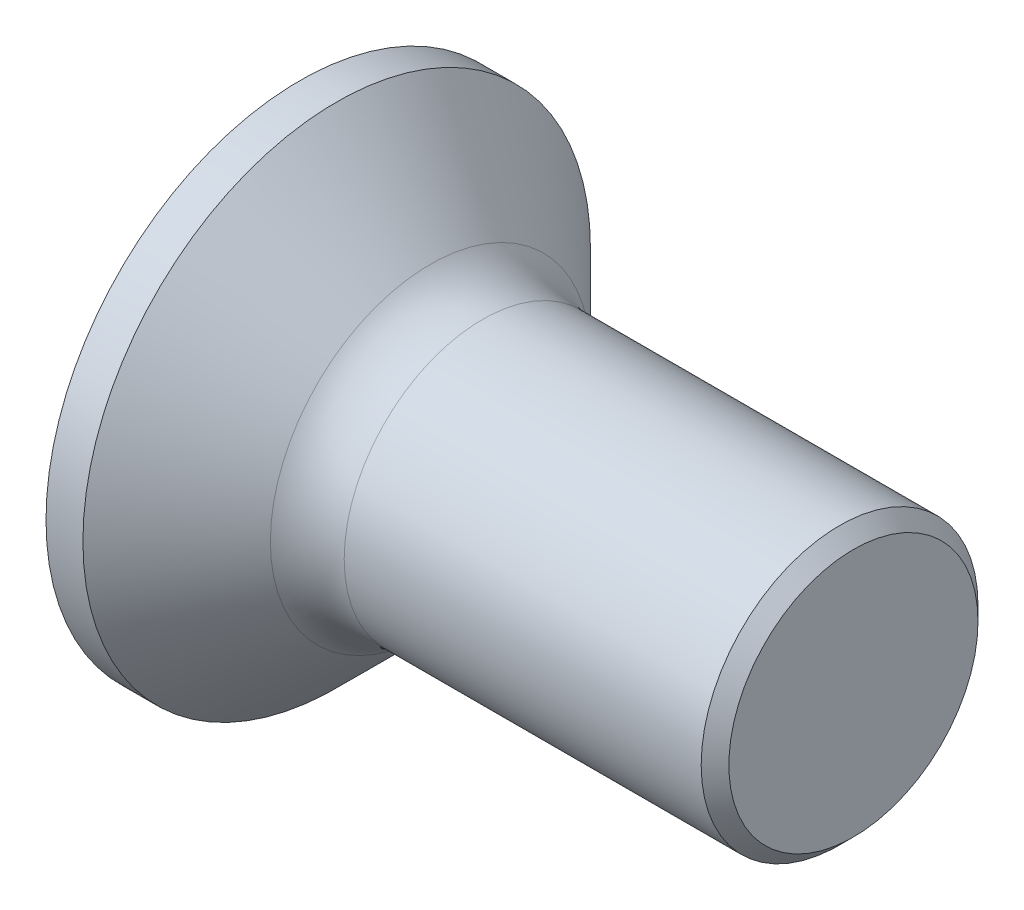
ISO-10303-21;
HEADER;
FILE_DESCRIPTION(('STEP AP214'),'2;1');
FILE_NAME('part.step','',(''),(''),'','','');
FILE_SCHEMA(('AUTOMOTIVE_DESIGN { 1 0 10303 214 1 1 1 1 }'));
ENDSEC;
DATA;
#1=APPLICATION_CONTEXT('core data for automotive mechanical design processes');
#2=APPLICATION_PROTOCOL_DEFINITION('international standard','automotive_design',2000,#1);
#3=PRODUCT_CONTEXT('',#1,'mechanical');
#4=PRODUCT('Part','Part','',(#3));
#5=PRODUCT_RELATED_PRODUCT_CATEGORY('part','',(#4));
#6=PRODUCT_DEFINITION_FORMATION('','',#4);
#7=PRODUCT_DEFINITION_CONTEXT('part definition',#1,'design');
#8=PRODUCT_DEFINITION('design','',#6,#7);
#9=PRODUCT_DEFINITION_SHAPE('','',#8);
#10=(LENGTH_UNIT() NAMED_UNIT(*) SI_UNIT(.MILLI.,.METRE.));
#11=(NAMED_UNIT(*) PLANE_ANGLE_UNIT() SI_UNIT($,.RADIAN.));
#12=(NAMED_UNIT(*) SI_UNIT($,.STERADIAN.) SOLID_ANGLE_UNIT());
#13=UNCERTAINTY_MEASURE_WITH_UNIT(LENGTH_MEASURE(1.E-05),#10,'distance_accuracy_value','');
#14=(GEOMETRIC_REPRESENTATION_CONTEXT(3) GLOBAL_UNCERTAINTY_ASSIGNED_CONTEXT((#13)) GLOBAL_UNIT_ASSIGNED_CONTEXT((#10,
#11,#12)) REPRESENTATION_CONTEXT('',''));
#15=CARTESIAN_POINT('',(0.,0.,0.));
#16=DIRECTION('',(0.,0.,1.));
#17=DIRECTION('',(1.,0.,0.));
#18=AXIS2_PLACEMENT_3D('',#15,#16,#17);
#19=CARTESIAN_POINT('',(0.2,0.,0.));
#20=DIRECTION('',(-1.,0.,0.));
#21=DIRECTION('',(0.,0.,1.));
#22=AXIS2_PLACEMENT_3D('',#19,#20,#21);
#23=CYLINDRICAL_SURFACE('',#22,2.75);
#24=CARTESIAN_POINT('',(0.4,0.,0.));
#25=DIRECTION('',(-1.,0.,0.));
#26=DIRECTION('',(0.,0.,-1.));
#27=AXIS2_PLACEMENT_3D('',#24,#25,#26);
#28=CIRCLE('',#27,2.75);
#29=CARTESIAN_POINT('',(0.4,0.,-2.75));
#30=VERTEX_POINT('',#29);
#31=EDGE_CURVE('E412',#30,#30,#28,.T.);
#32=ORIENTED_EDGE('',*,*,#31,.T.);
#33=EDGE_LOOP('',(#32));
#34=FACE_BOUND('',#33,.T.);
#35=CARTESIAN_POINT('',(0.,0.,0.));
#36=DIRECTION('',(-1.,0.,0.));
#37=DIRECTION('',(0.,0.,-1.));
#38=AXIS2_PLACEMENT_3D('',#35,#36,#37);
#39=CIRCLE('',#38,2.75);
#40=CARTESIAN_POINT('',(0.,0.,-2.75));
#41=VERTEX_POINT('',#40);
#42=EDGE_CURVE('E265',#41,#41,#39,.T.);
#43=ORIENTED_EDGE('',*,*,#42,.F.);
#44=EDGE_LOOP('',(#43));
#45=FACE_BOUND('',#44,.T.);
#46=ADVANCED_FACE('F17',(#34,#45),#23,.T.);
#47=DIRECTION('',(0.707106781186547,0.,0.707106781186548));
#48=VECTOR('',#47,1.);
#49=CARTESIAN_POINT('',(-498996.85,-1.22215714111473E-10,-499000.));
#50=LINE('',#49,#48);
#51=CARTESIAN_POINT('',(3.15,0.,0.));
#52=DIRECTION('',(-1.,0.,0.));
#53=AXIS1_PLACEMENT('',#51,#52);
#54=SURFACE_OF_REVOLUTION('',#50,#53);
#55=CARTESIAN_POINT('',(1.41568542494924,0.,0.));
#56=DIRECTION('',(-1.,0.,0.));
#57=DIRECTION('',(0.,0.,-1.));
#58=AXIS2_PLACEMENT_3D('',#55,#56,#57);
#59=CIRCLE('',#58,1.73431457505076);
#60=CARTESIAN_POINT('',(1.41568542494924,0.,-1.73431457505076));
#61=VERTEX_POINT('',#60);
#62=EDGE_CURVE('E11',#61,#61,#59,.T.);
#63=ORIENTED_EDGE('',*,*,#62,.T.);
#64=EDGE_LOOP('',(#63));
#65=FACE_BOUND('',#64,.T.);
#66=ORIENTED_EDGE('',*,*,#31,.F.);
#67=EDGE_LOOP('',(#66));
#68=FACE_BOUND('',#67,.T.);
#69=ADVANCED_FACE('F270',(#65,#68),#54,.F.);
#70=CARTESIAN_POINT('',(1.98137084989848,0.,0.));
#71=DIRECTION('',(-1.,0.,0.));
#72=DIRECTION('',(0.,0.,1.));
#73=AXIS2_PLACEMENT_3D('',#70,#71,#72);
#74=TOROIDAL_SURFACE('',#73,2.3,0.8);
#75=CARTESIAN_POINT('',(1.98137084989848,0.,0.));
#76=DIRECTION('',(-1.,0.,0.));
#77=DIRECTION('',(0.,0.,-1.));
#78=AXIS2_PLACEMENT_3D('',#75,#76,#77);
#79=CIRCLE('',#78,1.5);
#80=CARTESIAN_POINT('',(1.98137084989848,0.,-1.5));
#81=VERTEX_POINT('',#80);
#82=EDGE_CURVE('E27',#81,#81,#79,.T.);
#83=ORIENTED_EDGE('',*,*,#82,.T.);
#84=EDGE_LOOP('',(#83));
#85=FACE_BOUND('',#84,.T.);
#86=ORIENTED_EDGE('',*,*,#62,.F.);
#87=EDGE_LOOP('',(#86));
#88=FACE_BOUND('',#87,.T.);
#89=ADVANCED_FACE('F274',(#85,#88),#74,.F.);
#90=CARTESIAN_POINT('',(3.91568542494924,0.,0.));
#91=DIRECTION('',(-1.,0.,0.));
#92=DIRECTION('',(0.,0.,1.));
#93=AXIS2_PLACEMENT_3D('',#90,#91,#92);
#94=CYLINDRICAL_SURFACE('',#93,1.5);
#95=CARTESIAN_POINT('',(5.85,0.,0.));
#96=DIRECTION('',(-1.,0.,0.));
#97=DIRECTION('',(0.,0.,-1.));
#98=AXIS2_PLACEMENT_3D('',#95,#96,#97);
#99=CIRCLE('',#98,1.5);
#100=CARTESIAN_POINT('',(5.85,0.,-1.5));
#101=VERTEX_POINT('',#100);
#102=EDGE_CURVE('E448',#101,#101,#99,.T.);
#103=ORIENTED_EDGE('',*,*,#102,.T.);
#104=EDGE_LOOP('',(#103));
#105=FACE_BOUND('',#104,.T.);
#106=ORIENTED_EDGE('',*,*,#82,.F.);
#107=EDGE_LOOP('',(#106));
#108=FACE_BOUND('',#107,.T.);
#109=ADVANCED_FACE('F278',(#105,#108),#94,.T.);
#110=DIRECTION('',(0.707106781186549,0.,0.707106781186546));
#111=VECTOR('',#110,1.);
#112=CARTESIAN_POINT('',(-498992.650000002,-1.22215714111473E-10,-499000.));
#113=LINE('',#112,#111);
#114=CARTESIAN_POINT('',(7.35,0.,0.));
#115=DIRECTION('',(-1.,0.,0.));
#116=AXIS1_PLACEMENT('',#114,#115);
#117=SURFACE_OF_REVOLUTION('',#113,#116);
#118=CARTESIAN_POINT('',(6.,0.,0.));
#119=DIRECTION('',(-1.,0.,0.));
#120=DIRECTION('',(0.,0.,-1.));
#121=AXIS2_PLACEMENT_3D('',#118,#119,#120);
#122=CIRCLE('',#121,1.35);
#123=CARTESIAN_POINT('',(6.,0.,-1.35));
#124=VERTEX_POINT('',#123);
#125=EDGE_CURVE('E444',#124,#124,#122,.T.);
#126=ORIENTED_EDGE('',*,*,#125,.T.);
#127=EDGE_LOOP('',(#126));
#128=FACE_BOUND('',#127,.T.);
#129=ORIENTED_EDGE('',*,*,#102,.F.);
#130=EDGE_LOOP('',(#129));
#131=FACE_BOUND('',#130,.T.);
#132=ADVANCED_FACE('F282',(#128,#131),#117,.F.);
#133=CARTESIAN_POINT('',(6.,0.,-0.675));
#134=DIRECTION('',(1.,0.,0.));
#135=DIRECTION('',(0.,1.,0.));
#136=AXIS2_PLACEMENT_3D('',#133,#134,#135);
#137=PLANE('',#136);
#138=ORIENTED_EDGE('',*,*,#125,.F.);
#139=EDGE_LOOP('',(#138));
#140=FACE_BOUND('',#139,.T.);
#141=ADVANCED_FACE('F286',(#140),#137,.T.);
#142=CARTESIAN_POINT('',(-1.,-1.7,0.425));
#143=DIRECTION('',(0.,1.,0.));
#144=DIRECTION('',(0.,0.,1.));
#145=AXIS2_PLACEMENT_3D('',#142,#143,#144);
#146=PLANE('',#145);
#147=DIRECTION('',(0.,0.,-1.));
#148=VECTOR('',#147,1.);
#149=CARTESIAN_POINT('',(0.,-1.7,-0.475));
#150=LINE('',#149,#148);
#151=CARTESIAN_POINT('',(0.,-1.7,0.425));
#152=VERTEX_POINT('',#151);
#153=CARTESIAN_POINT('',(0.,-1.7,-0.425));
#154=VERTEX_POINT('',#153);
#155=EDGE_CURVE('E36',#152,#154,#150,.T.);
#156=ORIENTED_EDGE('',*,*,#155,.F.);
#157=DIRECTION('',(1.,0.,0.));
#158=VECTOR('',#157,1.);
#159=CARTESIAN_POINT('',(-1.,-1.7,0.425));
#160=LINE('',#159,#158);
#161=CARTESIAN_POINT('',(0.825,-1.7,0.425));
#162=VERTEX_POINT('',#161);
#163=EDGE_CURVE('E423',#152,#162,#160,.T.);
#164=ORIENTED_EDGE('',*,*,#163,.T.);
#165=DIRECTION('',(0.,0.,-1.));
#166=VECTOR('',#165,1.);
#167=CARTESIAN_POINT('',(0.825,-1.7,0.425));
#168=LINE('',#167,#166);
#169=CARTESIAN_POINT('',(0.825,-1.7,-0.425));
#170=VERTEX_POINT('',#169);
#171=EDGE_CURVE('E227',#162,#170,#168,.T.);
#172=ORIENTED_EDGE('',*,*,#171,.T.);
#173=DIRECTION('',(1.,0.,0.));
#174=VECTOR('',#173,1.);
#175=CARTESIAN_POINT('',(-1.,-1.7,-0.425));
#176=LINE('',#175,#174);
#177=EDGE_CURVE('E434',#154,#170,#176,.T.);
#178=ORIENTED_EDGE('',*,*,#177,.F.);
#179=EDGE_LOOP('',(#156,#164,#172,#178));
#180=FACE_BOUND('',#179,.T.);
#181=ADVANCED_FACE('F290',(#180),#146,.T.);
#182=CARTESIAN_POINT('',(2.5245,0.425,0.425));
#183=DIRECTION('',(-0.600112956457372,-0.799915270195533,0.));
#184=DIRECTION('',(0.799915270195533,-0.600112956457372,0.));
#185=AXIS2_PLACEMENT_3D('',#182,#183,#184);
#186=PLANE('',#185);
#187=DIRECTION('',(-0.799915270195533,0.600112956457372,0.));
#188=VECTOR('',#187,1.);
#189=CARTESIAN_POINT('',(2.5245,0.425,-0.425));
#190=LINE('',#189,#188);
#191=CARTESIAN_POINT('',(2.5245,0.425,-0.425));
#192=VERTEX_POINT('',#191);
#193=CARTESIAN_POINT('',(0.825,1.7,-0.425));
#194=VERTEX_POINT('',#193);
#195=EDGE_CURVE('E459',#192,#194,#190,.T.);
#196=ORIENTED_EDGE('',*,*,#195,.F.);
#197=DIRECTION('',(0.,0.,-1.));
#198=VECTOR('',#197,1.);
#199=CARTESIAN_POINT('',(2.5245,0.425,0.425));
#200=LINE('',#199,#198);
#201=CARTESIAN_POINT('',(2.5245,0.425,0.425));
#202=VERTEX_POINT('',#201);
#203=EDGE_CURVE('E462',#202,#192,#200,.T.);
#204=ORIENTED_EDGE('',*,*,#203,.F.);
#205=DIRECTION('',(-0.799915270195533,0.600112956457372,0.));
#206=VECTOR('',#205,1.);
#207=CARTESIAN_POINT('',(2.5245,0.425,0.425));
#208=LINE('',#207,#206);
#209=CARTESIAN_POINT('',(0.825,1.7,0.425));
#210=VERTEX_POINT('',#209);
#211=EDGE_CURVE('E224',#202,#210,#208,.T.);
#212=ORIENTED_EDGE('',*,*,#211,.T.);
#213=DIRECTION('',(0.,0.,-1.));
#214=VECTOR('',#213,1.);
#215=CARTESIAN_POINT('',(0.825,1.7,0.425));
#216=LINE('',#215,#214);
#217=EDGE_CURVE('E228',#210,#194,#216,.T.);
#218=ORIENTED_EDGE('',*,*,#217,.T.);
#219=EDGE_LOOP('',(#196,#204,#212,#218));
#220=FACE_BOUND('',#219,.T.);
#221=ADVANCED_FACE('F294',(#220),#186,.T.);
#222=CARTESIAN_POINT('',(2.5245,-0.425,0.425));
#223=DIRECTION('',(-1.,0.,0.));
#224=DIRECTION('',(0.,0.,1.));
#225=AXIS2_PLACEMENT_3D('',#222,#223,#224);
#226=PLANE('',#225);
#227=DIRECTION('',(0.,0.,-1.));
#228=VECTOR('',#227,1.);
#229=CARTESIAN_POINT('',(2.5245,-0.419753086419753,0.2125));
#230=LINE('',#229,#228);
#231=CARTESIAN_POINT('',(2.5245,-0.419753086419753,0.425));
#232=VERTEX_POINT('',#231);
#233=CARTESIAN_POINT('',(2.5245,-0.419753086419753,-0.425));
#234=VERTEX_POINT('',#233);
#235=EDGE_CURVE('E483',#232,#234,#230,.T.);
#236=ORIENTED_EDGE('',*,*,#235,.T.);
#237=DIRECTION('',(0.,1.,0.));
#238=VECTOR('',#237,1.);
#239=CARTESIAN_POINT('',(2.5245,-0.425,-0.425));
#240=LINE('',#239,#238);
#241=CARTESIAN_POINT('',(2.5245,-0.425,-0.425));
#242=VERTEX_POINT('',#241);
#243=EDGE_CURVE('E435',#242,#234,#240,.T.);
#244=ORIENTED_EDGE('',*,*,#243,.F.);
#245=DIRECTION('',(0.,0.,-1.));
#246=VECTOR('',#245,1.);
#247=CARTESIAN_POINT('',(2.5245,-0.425,0.425));
#248=LINE('',#247,#246);
#249=CARTESIAN_POINT('',(2.5245,-0.425,0.425));
#250=VERTEX_POINT('',#249);
#251=EDGE_CURVE('E512',#250,#242,#248,.T.);
#252=ORIENTED_EDGE('',*,*,#251,.F.);
#253=DIRECTION('',(0.,1.,0.));
#254=VECTOR('',#253,1.);
#255=CARTESIAN_POINT('',(2.5245,-0.425,0.425));
#256=LINE('',#255,#254);
#257=EDGE_CURVE('E481',#250,#232,#256,.T.);
#258=ORIENTED_EDGE('',*,*,#257,.T.);
#259=EDGE_LOOP('',(#236,#244,#252,#258));
#260=FACE_BOUND('',#259,.T.);
#261=ADVANCED_FACE('F297',(#260),#226,.T.);
#262=CARTESIAN_POINT('',(0.825,-1.7,0.425));
#263=DIRECTION('',(-0.600112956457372,0.799915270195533,0.));
#264=DIRECTION('',(-0.799915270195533,-0.600112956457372,0.));
#265=AXIS2_PLACEMENT_3D('',#262,#263,#264);
#266=PLANE('',#265);
#267=DIRECTION('',(0.799915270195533,0.600112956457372,0.));
#268=VECTOR('',#267,1.);
#269=CARTESIAN_POINT('',(0.825,-1.7,-0.425));
#270=LINE('',#269,#268);
#271=EDGE_CURVE('E431',#170,#242,#270,.T.);
#272=ORIENTED_EDGE('',*,*,#271,.F.);
#273=ORIENTED_EDGE('',*,*,#171,.F.);
#274=DIRECTION('',(0.799915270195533,0.600112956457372,0.));
#275=VECTOR('',#274,1.);
#276=CARTESIAN_POINT('',(0.825,-1.7,0.425));
#277=LINE('',#276,#275);
#278=EDGE_CURVE('E484',#162,#250,#277,.T.);
#279=ORIENTED_EDGE('',*,*,#278,.T.);
#280=ORIENTED_EDGE('',*,*,#251,.T.);
#281=EDGE_LOOP('',(#272,#273,#279,#280));
#282=FACE_BOUND('',#281,.T.);
#283=ADVANCED_FACE('F301',(#282),#266,.T.);
#284=CARTESIAN_POINT('',(0.825,1.7,0.425));
#285=DIRECTION('',(0.,-1.,0.));
#286=DIRECTION('',(0.,0.,-1.));
#287=AXIS2_PLACEMENT_3D('',#284,#285,#286);
#288=PLANE('',#287);
#289=DIRECTION('',(0.,0.,1.));
#290=VECTOR('',#289,1.);
#291=CARTESIAN_POINT('',(0.,1.7,-0.475));
#292=LINE('',#291,#290);
#293=CARTESIAN_POINT('',(0.,1.7,-0.425));
#294=VERTEX_POINT('',#293);
#295=CARTESIAN_POINT('',(0.,1.7,0.425));
#296=VERTEX_POINT('',#295);
#297=EDGE_CURVE('E436',#294,#296,#292,.T.);
#298=ORIENTED_EDGE('',*,*,#297,.F.);
#299=DIRECTION('',(-1.,0.,0.));
#300=VECTOR('',#299,1.);
#301=CARTESIAN_POINT('',(0.825,1.7,-0.425));
#302=LINE('',#301,#300);
#303=EDGE_CURVE('E456',#194,#294,#302,.T.);
#304=ORIENTED_EDGE('',*,*,#303,.F.);
#305=ORIENTED_EDGE('',*,*,#217,.F.);
#306=DIRECTION('',(-1.,0.,0.));
#307=VECTOR('',#306,1.);
#308=CARTESIAN_POINT('',(0.825,1.7,0.425));
#309=LINE('',#308,#307);
#310=EDGE_CURVE('E222',#210,#296,#309,.T.);
#311=ORIENTED_EDGE('',*,*,#310,.T.);
#312=EDGE_LOOP('',(#298,#304,#305,#311));
#313=FACE_BOUND('',#312,.T.);
#314=ADVANCED_FACE('F305',(#313),#288,.T.);
#315=CARTESIAN_POINT('',(0.,0.,0.425));
#316=DIRECTION('',(0.,0.,-1.));
#317=DIRECTION('',(-1.,0.,0.));
#318=AXIS2_PLACEMENT_3D('',#315,#316,#317);
#319=PLANE('',#318);
#320=DIRECTION('',(-1.,0.,0.));
#321=VECTOR('',#320,1.);
#322=CARTESIAN_POINT('',(0.,0.55003270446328,0.425));
#323=LINE('',#322,#321);
#324=CARTESIAN_POINT('',(1.,0.55003270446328,0.425));
#325=VERTEX_POINT('',#324);
#326=CARTESIAN_POINT('',(0.,0.55003270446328,0.425));
#327=VERTEX_POINT('',#326);
#328=EDGE_CURVE('E219',#325,#327,#323,.T.);
#329=ORIENTED_EDGE('',*,*,#328,.T.);
#330=DIRECTION('',(0.,-1.,0.));
#331=VECTOR('',#330,1.);
#332=CARTESIAN_POINT('',(0.,0.,0.425));
#333=LINE('',#332,#331);
#334=EDGE_CURVE('E439',#296,#327,#333,.T.);
#335=ORIENTED_EDGE('',*,*,#334,.F.);
#336=ORIENTED_EDGE('',*,*,#310,.F.);
#337=ORIENTED_EDGE('',*,*,#211,.F.);
#338=DIRECTION('',(0.,1.,0.));
#339=VECTOR('',#338,1.);
#340=CARTESIAN_POINT('',(2.5245,-0.425,0.425));
#341=LINE('',#340,#339);
#342=CARTESIAN_POINT('',(2.5245,0.419753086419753,0.425));
#343=VERTEX_POINT('',#342);
#344=EDGE_CURVE('E465',#343,#202,#341,.T.);
#345=ORIENTED_EDGE('',*,*,#344,.F.);
#346=DIRECTION('',(-1.,0.,0.));
#347=VECTOR('',#346,1.);
#348=CARTESIAN_POINT('',(0.,0.419753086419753,0.425));
#349=LINE('',#348,#347);
#350=CARTESIAN_POINT('',(1.,0.419753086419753,0.425));
#351=VERTEX_POINT('',#350);
#352=EDGE_CURVE('E223',#343,#351,#349,.T.);
#353=ORIENTED_EDGE('',*,*,#352,.T.);
#354=DIRECTION('',(0.,1.,0.));
#355=VECTOR('',#354,1.);
#356=CARTESIAN_POINT('',(1.,0.,0.425));
#357=LINE('',#356,#355);
#358=EDGE_CURVE('E469',#351,#325,#357,.T.);
#359=ORIENTED_EDGE('',*,*,#358,.T.);
#360=EDGE_LOOP('',(#329,#335,#336,#337,#345,#353,#359));
#361=FACE_BOUND('',#360,.T.);
#362=ADVANCED_FACE('F309',(#361),#319,.T.);
#363=CARTESIAN_POINT('',(2.5245,-0.425,0.425));
#364=DIRECTION('',(-1.,0.,0.));
#365=DIRECTION('',(0.,0.,1.));
#366=AXIS2_PLACEMENT_3D('',#363,#364,#365);
#367=PLANE('',#366);
#368=DIRECTION('',(0.,0.,1.));
#369=VECTOR('',#368,1.);
#370=CARTESIAN_POINT('',(2.5245,0.419753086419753,0.2125));
#371=LINE('',#370,#369);
#372=CARTESIAN_POINT('',(2.5245,0.419753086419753,-0.425));
#373=VERTEX_POINT('',#372);
#374=EDGE_CURVE('E472',#373,#343,#371,.T.);
#375=ORIENTED_EDGE('',*,*,#374,.T.);
#376=ORIENTED_EDGE('',*,*,#344,.T.);
#377=ORIENTED_EDGE('',*,*,#203,.T.);
#378=DIRECTION('',(0.,1.,0.));
#379=VECTOR('',#378,1.);
#380=CARTESIAN_POINT('',(2.5245,-0.425,-0.425));
#381=LINE('',#380,#379);
#382=EDGE_CURVE('E519',#373,#192,#381,.T.);
#383=ORIENTED_EDGE('',*,*,#382,.F.);
#384=EDGE_LOOP('',(#375,#376,#377,#383));
#385=FACE_BOUND('',#384,.T.);
#386=ADVANCED_FACE('F313',(#385),#367,.T.);
#387=CARTESIAN_POINT('',(0.,0.,-0.425));
#388=DIRECTION('',(0.,0.,1.));
#389=DIRECTION('',(1.,0.,0.));
#390=AXIS2_PLACEMENT_3D('',#387,#388,#389);
#391=PLANE('',#390);
#392=DIRECTION('',(-1.,0.,0.));
#393=VECTOR('',#392,1.);
#394=CARTESIAN_POINT('',(0.,-0.55003270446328,-0.425));
#395=LINE('',#394,#393);
#396=CARTESIAN_POINT('',(1.,-0.55003270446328,-0.425));
#397=VERTEX_POINT('',#396);
#398=CARTESIAN_POINT('',(0.,-0.55003270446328,-0.425));
#399=VERTEX_POINT('',#398);
#400=EDGE_CURVE('E466',#397,#399,#395,.T.);
#401=ORIENTED_EDGE('',*,*,#400,.T.);
#402=DIRECTION('',(0.,1.,0.));
#403=VECTOR('',#402,1.);
#404=CARTESIAN_POINT('',(0.,0.,-0.425));
#405=LINE('',#404,#403);
#406=EDGE_CURVE('E443',#154,#399,#405,.T.);
#407=ORIENTED_EDGE('',*,*,#406,.F.);
#408=ORIENTED_EDGE('',*,*,#177,.T.);
#409=ORIENTED_EDGE('',*,*,#271,.T.);
#410=ORIENTED_EDGE('',*,*,#243,.T.);
#411=DIRECTION('',(-1.,0.,0.));
#412=VECTOR('',#411,1.);
#413=CARTESIAN_POINT('',(0.,-0.419753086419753,-0.425));
#414=LINE('',#413,#412);
#415=CARTESIAN_POINT('',(1.,-0.419753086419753,-0.425));
#416=VERTEX_POINT('',#415);
#417=EDGE_CURVE('E418',#234,#416,#414,.T.);
#418=ORIENTED_EDGE('',*,*,#417,.T.);
#419=DIRECTION('',(0.,-1.,0.));
#420=VECTOR('',#419,1.);
#421=CARTESIAN_POINT('',(1.,0.,-0.425));
#422=LINE('',#421,#420);
#423=EDGE_CURVE('E415',#416,#397,#422,.T.);
#424=ORIENTED_EDGE('',*,*,#423,.T.);
#425=EDGE_LOOP('',(#401,#407,#408,#409,#410,#418,#424));
#426=FACE_BOUND('',#425,.T.);
#427=ADVANCED_FACE('F317',(#426),#391,.T.);
#428=CARTESIAN_POINT('',(0.,0.,-1.375));
#429=DIRECTION('',(-1.,0.,0.));
#430=DIRECTION('',(0.,0.,1.));
#431=AXIS2_PLACEMENT_3D('',#428,#429,#430);
#432=PLANE('',#431);
#433=ORIENTED_EDGE('',*,*,#42,.T.);
#434=EDGE_LOOP('',(#433));
#435=FACE_BOUND('',#434,.T.);
#436=DIRECTION('',(0.,-0.642787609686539,0.766044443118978));
#437=VECTOR('',#436,1.);
#438=CARTESIAN_POINT('',(0.,0.491985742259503,-0.355822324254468));
#439=LINE('',#438,#437);
#440=CARTESIAN_POINT('',(0.,1.20208152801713,-1.20208152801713));
#441=VERTEX_POINT('',#440);
#442=CARTESIAN_POINT('',(0.,0.55003270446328,-0.425));
#443=VERTEX_POINT('',#442);
#444=EDGE_CURVE('E263',#441,#443,#439,.T.);
#445=ORIENTED_EDGE('',*,*,#444,.T.);
#446=DIRECTION('',(0.,1.,0.));
#447=VECTOR('',#446,1.);
#448=CARTESIAN_POINT('',(0.,0.,-0.425));
#449=LINE('',#448,#447);
#450=EDGE_CURVE('E266',#443,#294,#449,.T.);
#451=ORIENTED_EDGE('',*,*,#450,.T.);
#452=ORIENTED_EDGE('',*,*,#297,.T.);
#453=ORIENTED_EDGE('',*,*,#334,.T.);
#454=DIRECTION('',(0.,0.642787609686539,0.766044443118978));
#455=VECTOR('',#454,1.);
#456=CARTESIAN_POINT('',(0.,0.319263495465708,0.149979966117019));
#457=LINE('',#456,#455);
#458=CARTESIAN_POINT('',(0.,1.20208152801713,1.20208152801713));
#459=VERTEX_POINT('',#458);
#460=EDGE_CURVE('E555',#327,#459,#457,.T.);
#461=ORIENTED_EDGE('',*,*,#460,.T.);
#462=DIRECTION('',(0.,-0.766044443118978,-0.642787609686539));
#463=VECTOR('',#462,1.);
#464=CARTESIAN_POINT('',(0.,-0.386146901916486,-0.130600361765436));
#465=LINE('',#464,#463);
#466=CARTESIAN_POINT('',(0.,0.419753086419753,0.545630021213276));
#467=VERTEX_POINT('',#466);
#468=EDGE_CURVE('E191',#459,#467,#465,.T.);
#469=ORIENTED_EDGE('',*,*,#468,.T.);
#470=DIRECTION('',(0.,0.,1.));
#471=VECTOR('',#470,1.);
#472=CARTESIAN_POINT('',(0.,0.419753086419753,-0.6875));
#473=LINE('',#472,#471);
#474=CARTESIAN_POINT('',(0.,0.419753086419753,1.7));
#475=VERTEX_POINT('',#474);
#476=EDGE_CURVE('E184',#467,#475,#473,.T.);
#477=ORIENTED_EDGE('',*,*,#476,.T.);
#478=DIRECTION('',(0.,-1.,0.));
#479=VECTOR('',#478,1.);
#480=CARTESIAN_POINT('',(0.,0.209876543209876,1.7));
#481=LINE('',#480,#479);
#482=CARTESIAN_POINT('',(0.,-0.419753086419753,1.7));
#483=VERTEX_POINT('',#482);
#484=EDGE_CURVE('E175',#475,#483,#481,.T.);
#485=ORIENTED_EDGE('',*,*,#484,.T.);
#486=DIRECTION('',(0.,0.,-1.));
#487=VECTOR('',#486,1.);
#488=CARTESIAN_POINT('',(0.,-0.419753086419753,-0.6875));
#489=LINE('',#488,#487);
#490=CARTESIAN_POINT('',(0.,-0.419753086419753,0.545630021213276));
#491=VERTEX_POINT('',#490);
#492=EDGE_CURVE('E185',#483,#491,#489,.T.);
#493=ORIENTED_EDGE('',*,*,#492,.T.);
#494=DIRECTION('',(0.,-0.766044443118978,0.642787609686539));
#495=VECTOR('',#494,1.);
#496=CARTESIAN_POINT('',(0.,-0.214893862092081,0.373732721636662));
#497=LINE('',#496,#495);
#498=CARTESIAN_POINT('',(0.,-1.20208152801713,1.20208152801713));
#499=VERTEX_POINT('',#498);
#500=EDGE_CURVE('E450',#491,#499,#497,.T.);
#501=ORIENTED_EDGE('',*,*,#500,.T.);
#502=DIRECTION('',(0.,0.642787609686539,-0.766044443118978));
#503=VECTOR('',#502,1.);
#504=CARTESIAN_POINT('',(0.,0.18506958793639,-0.451060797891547));
#505=LINE('',#504,#503);
#506=CARTESIAN_POINT('',(0.,-0.55003270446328,0.425));
#507=VERTEX_POINT('',#506);
#508=EDGE_CURVE('E487',#499,#507,#505,.T.);
#509=ORIENTED_EDGE('',*,*,#508,.T.);
#510=DIRECTION('',(0.,-1.,0.));
#511=VECTOR('',#510,1.);
#512=CARTESIAN_POINT('',(0.,0.,0.425));
#513=LINE('',#512,#511);
#514=EDGE_CURVE('E561',#507,#152,#513,.T.);
#515=ORIENTED_EDGE('',*,*,#514,.T.);
#516=ORIENTED_EDGE('',*,*,#155,.T.);
#517=ORIENTED_EDGE('',*,*,#406,.T.);
#518=DIRECTION('',(0.,-0.642787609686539,-0.766044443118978));
#519=VECTOR('',#518,1.);
#520=CARTESIAN_POINT('',(0.,-0.996318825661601,-0.956863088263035));
#521=LINE('',#520,#519);
#522=CARTESIAN_POINT('',(0.,-1.20208152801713,-1.20208152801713));
#523=VERTEX_POINT('',#522);
#524=EDGE_CURVE('E257',#399,#523,#521,.T.);
#525=ORIENTED_EDGE('',*,*,#524,.T.);
#526=DIRECTION('',(0.,0.766044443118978,0.642787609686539));
#527=VECTOR('',#526,1.);
#528=CARTESIAN_POINT('',(0.,-0.290908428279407,-0.437516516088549));
#529=LINE('',#528,#527);
#530=CARTESIAN_POINT('',(0.,-0.419753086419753,-0.545630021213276));
#531=VERTEX_POINT('',#530);
#532=EDGE_CURVE('E255',#523,#531,#529,.T.);
#533=ORIENTED_EDGE('',*,*,#532,.T.);
#534=DIRECTION('',(0.,0.,-1.));
#535=VECTOR('',#534,1.);
#536=CARTESIAN_POINT('',(0.,-0.419753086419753,-0.6875));
#537=LINE('',#536,#535);
#538=CARTESIAN_POINT('',(0.,-0.419753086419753,-1.7));
#539=VERTEX_POINT('',#538);
#540=EDGE_CURVE('E258',#531,#539,#537,.T.);
#541=ORIENTED_EDGE('',*,*,#540,.T.);
#542=DIRECTION('',(0.,1.,0.));
#543=VECTOR('',#542,1.);
#544=CARTESIAN_POINT('',(0.,0.209876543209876,-1.7));
#545=LINE('',#544,#543);
#546=CARTESIAN_POINT('',(0.,0.419753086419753,-1.7));
#547=VERTEX_POINT('',#546);
#548=EDGE_CURVE('E500',#539,#547,#545,.T.);
#549=ORIENTED_EDGE('',*,*,#548,.T.);
#550=DIRECTION('',(0.,0.,1.));
#551=VECTOR('',#550,1.);
#552=CARTESIAN_POINT('',(0.,0.419753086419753,-0.6875));
#553=LINE('',#552,#551);
#554=CARTESIAN_POINT('',(0.,0.419753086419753,-0.545630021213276));
#555=VERTEX_POINT('',#554);
#556=EDGE_CURVE('E503',#547,#555,#553,.T.);
#557=ORIENTED_EDGE('',*,*,#556,.T.);
#558=DIRECTION('',(0.,0.766044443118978,-0.642787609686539));
#559=VECTOR('',#558,1.);
#560=CARTESIAN_POINT('',(0.,0.891949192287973,-0.941849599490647));
#561=LINE('',#560,#559);
#562=EDGE_CURVE('E460',#555,#441,#561,.T.);
#563=ORIENTED_EDGE('',*,*,#562,.T.);
#564=EDGE_LOOP('',(#445,#451,#452,#453,#461,#469,#477,#485,#493,#501,#509,#515,#516,#517,#525,
#533,#541,#549,#557,#563));
#565=FACE_BOUND('',#564,.T.);
#566=ADVANCED_FACE('F189',(#435,#565),#432,.T.);
#567=CARTESIAN_POINT('',(0.,-0.419753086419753,0.));
#568=DIRECTION('',(0.,1.,0.));
#569=DIRECTION('',(0.,0.,1.));
#570=AXIS2_PLACEMENT_3D('',#567,#568,#569);
#571=PLANE('',#570);
#572=DIRECTION('',(0.,0.,1.));
#573=VECTOR('',#572,1.);
#574=CARTESIAN_POINT('',(1.,-0.419753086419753,0.));
#575=LINE('',#574,#573);
#576=CARTESIAN_POINT('',(1.,-0.419753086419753,-0.545630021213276));
#577=VERTEX_POINT('',#576);
#578=EDGE_CURVE('E262',#577,#416,#575,.T.);
#579=ORIENTED_EDGE('',*,*,#578,.T.);
#580=ORIENTED_EDGE('',*,*,#417,.F.);
#581=ORIENTED_EDGE('',*,*,#235,.F.);
#582=DIRECTION('',(1.,0.,0.));
#583=VECTOR('',#582,1.);
#584=CARTESIAN_POINT('',(0.,-0.419753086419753,0.425));
#585=LINE('',#584,#583);
#586=CARTESIAN_POINT('',(1.,-0.419753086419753,0.425));
#587=VERTEX_POINT('',#586);
#588=EDGE_CURVE('E218',#587,#232,#585,.T.);
#589=ORIENTED_EDGE('',*,*,#588,.F.);
#590=DIRECTION('',(0.,0.,1.));
#591=VECTOR('',#590,1.);
#592=CARTESIAN_POINT('',(1.,-0.419753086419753,0.));
#593=LINE('',#592,#591);
#594=CARTESIAN_POINT('',(1.,-0.419753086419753,0.545630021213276));
#595=VERTEX_POINT('',#594);
#596=EDGE_CURVE('E254',#587,#595,#593,.T.);
#597=ORIENTED_EDGE('',*,*,#596,.T.);
#598=DIRECTION('',(-1.,0.,0.));
#599=VECTOR('',#598,1.);
#600=CARTESIAN_POINT('',(0.,-0.419753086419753,0.545630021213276));
#601=LINE('',#600,#599);
#602=EDGE_CURVE('E244',#595,#491,#601,.T.);
#603=ORIENTED_EDGE('',*,*,#602,.T.);
#604=ORIENTED_EDGE('',*,*,#492,.F.);
#605=DIRECTION('',(1.,0.,0.));
#606=VECTOR('',#605,1.);
#607=CARTESIAN_POINT('',(-1.,-0.419753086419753,1.7));
#608=LINE('',#607,#606);
#609=CARTESIAN_POINT('',(0.825,-0.419753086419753,1.7));
#610=VERTEX_POINT('',#609);
#611=EDGE_CURVE('E181',#483,#610,#608,.T.);
#612=ORIENTED_EDGE('',*,*,#611,.T.);
#613=DIRECTION('',(0.802769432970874,0.,-0.596289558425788));
#614=VECTOR('',#613,1.);
#615=CARTESIAN_POINT('',(0.825,-0.419753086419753,1.7));
#616=LINE('',#615,#614);
#617=CARTESIAN_POINT('',(2.5415,-0.419753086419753,0.425));
#618=VERTEX_POINT('',#617);
#619=EDGE_CURVE('E232',#610,#618,#616,.T.);
#620=ORIENTED_EDGE('',*,*,#619,.T.);
#621=DIRECTION('',(0.,0.,-1.));
#622=VECTOR('',#621,1.);
#623=CARTESIAN_POINT('',(2.5415,-0.419753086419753,0.425));
#624=LINE('',#623,#622);
#625=CARTESIAN_POINT('',(2.5415,-0.419753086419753,-0.425));
#626=VERTEX_POINT('',#625);
#627=EDGE_CURVE('E229',#618,#626,#624,.T.);
#628=ORIENTED_EDGE('',*,*,#627,.T.);
#629=DIRECTION('',(-0.802769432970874,0.,-0.596289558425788));
#630=VECTOR('',#629,1.);
#631=CARTESIAN_POINT('',(2.5415,-0.419753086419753,-0.425));
#632=LINE('',#631,#630);
#633=CARTESIAN_POINT('',(0.825,-0.419753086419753,-1.7));
#634=VERTEX_POINT('',#633);
#635=EDGE_CURVE('E233',#626,#634,#632,.T.);
#636=ORIENTED_EDGE('',*,*,#635,.T.);
#637=DIRECTION('',(-1.,0.,0.));
#638=VECTOR('',#637,1.);
#639=CARTESIAN_POINT('',(0.825,-0.419753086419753,-1.7));
#640=LINE('',#639,#638);
#641=EDGE_CURVE('E206',#634,#539,#640,.T.);
#642=ORIENTED_EDGE('',*,*,#641,.T.);
#643=ORIENTED_EDGE('',*,*,#540,.F.);
#644=DIRECTION('',(1.,0.,0.));
#645=VECTOR('',#644,1.);
#646=CARTESIAN_POINT('',(0.,-0.419753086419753,-0.545630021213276));
#647=LINE('',#646,#645);
#648=EDGE_CURVE('E202',#531,#577,#647,.T.);
#649=ORIENTED_EDGE('',*,*,#648,.T.);
#650=EDGE_LOOP('',(#579,#580,#581,#589,#597,#603,#604,#612,#620,#628,#636,#642,#643,#649));
#651=FACE_BOUND('',#650,.T.);
#652=ADVANCED_FACE('F324',(#651),#571,.T.);
#653=CARTESIAN_POINT('',(-1.,0.419753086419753,1.7));
#654=DIRECTION('',(0.,0.,-1.));
#655=DIRECTION('',(-1.,0.,0.));
#656=AXIS2_PLACEMENT_3D('',#653,#654,#655);
#657=PLANE('',#656);
#658=ORIENTED_EDGE('',*,*,#484,.F.);
#659=DIRECTION('',(1.,0.,0.));
#660=VECTOR('',#659,1.);
#661=CARTESIAN_POINT('',(-1.,0.419753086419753,1.7));
#662=LINE('',#661,#660);
#663=CARTESIAN_POINT('',(0.825,0.419753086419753,1.7));
#664=VERTEX_POINT('',#663);
#665=EDGE_CURVE('E179',#475,#664,#662,.T.);
#666=ORIENTED_EDGE('',*,*,#665,.T.);
#667=DIRECTION('',(0.,-1.,0.));
#668=VECTOR('',#667,1.);
#669=CARTESIAN_POINT('',(0.825,0.419753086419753,1.7));
#670=LINE('',#669,#668);
#671=EDGE_CURVE('E203',#664,#610,#670,.T.);
#672=ORIENTED_EDGE('',*,*,#671,.T.);
#673=ORIENTED_EDGE('',*,*,#611,.F.);
#674=EDGE_LOOP('',(#658,#666,#672,#673));
#675=FACE_BOUND('',#674,.T.);
#676=ADVANCED_FACE('F177',(#675),#657,.T.);
#677=CARTESIAN_POINT('',(2.5415,0.419753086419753,-0.425));
#678=DIRECTION('',(-0.596289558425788,0.,0.802769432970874));
#679=DIRECTION('',(0.802769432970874,0.,0.596289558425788));
#680=AXIS2_PLACEMENT_3D('',#677,#678,#679);
#681=PLANE('',#680);
#682=ORIENTED_EDGE('',*,*,#635,.F.);
#683=DIRECTION('',(0.,-1.,0.));
#684=VECTOR('',#683,1.);
#685=CARTESIAN_POINT('',(2.5415,0.419753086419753,-0.425));
#686=LINE('',#685,#684);
#687=CARTESIAN_POINT('',(2.5415,0.419753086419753,-0.425));
#688=VERTEX_POINT('',#687);
#689=EDGE_CURVE('E245',#688,#626,#686,.T.);
#690=ORIENTED_EDGE('',*,*,#689,.F.);
#691=DIRECTION('',(-0.802769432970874,0.,-0.596289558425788));
#692=VECTOR('',#691,1.);
#693=CARTESIAN_POINT('',(2.5415,0.419753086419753,-0.425));
#694=LINE('',#693,#692);
#695=CARTESIAN_POINT('',(0.825,0.419753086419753,-1.7));
#696=VERTEX_POINT('',#695);
#697=EDGE_CURVE('E208',#688,#696,#694,.T.);
#698=ORIENTED_EDGE('',*,*,#697,.T.);
#699=DIRECTION('',(0.,-1.,0.));
#700=VECTOR('',#699,1.);
#701=CARTESIAN_POINT('',(0.825,0.419753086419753,-1.7));
#702=LINE('',#701,#700);
#703=EDGE_CURVE('E451',#696,#634,#702,.T.);
#704=ORIENTED_EDGE('',*,*,#703,.T.);
#705=EDGE_LOOP('',(#682,#690,#698,#704));
#706=FACE_BOUND('',#705,.T.);
#707=ADVANCED_FACE('F331',(#706),#681,.T.);
#708=CARTESIAN_POINT('',(2.5415,0.419753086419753,0.425));
#709=DIRECTION('',(-1.,0.,0.));
#710=DIRECTION('',(0.,0.,1.));
#711=AXIS2_PLACEMENT_3D('',#708,#709,#710);
#712=PLANE('',#711);
#713=ORIENTED_EDGE('',*,*,#627,.F.);
#714=DIRECTION('',(0.,-1.,0.));
#715=VECTOR('',#714,1.);
#716=CARTESIAN_POINT('',(2.5415,0.419753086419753,0.425));
#717=LINE('',#716,#715);
#718=CARTESIAN_POINT('',(2.5415,0.419753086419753,0.425));
#719=VERTEX_POINT('',#718);
#720=EDGE_CURVE('E492',#719,#618,#717,.T.);
#721=ORIENTED_EDGE('',*,*,#720,.F.);
#722=DIRECTION('',(0.,0.,-1.));
#723=VECTOR('',#722,1.);
#724=CARTESIAN_POINT('',(2.5415,0.419753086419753,0.425));
#725=LINE('',#724,#723);
#726=EDGE_CURVE('E248',#719,#688,#725,.T.);
#727=ORIENTED_EDGE('',*,*,#726,.T.);
#728=ORIENTED_EDGE('',*,*,#689,.T.);
#729=EDGE_LOOP('',(#713,#721,#727,#728));
#730=FACE_BOUND('',#729,.T.);
#731=ADVANCED_FACE('F334',(#730),#712,.T.);
#732=CARTESIAN_POINT('',(0.825,0.419753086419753,1.7));
#733=DIRECTION('',(-0.596289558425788,0.,-0.802769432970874));
#734=DIRECTION('',(-0.802769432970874,0.,0.596289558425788));
#735=AXIS2_PLACEMENT_3D('',#732,#733,#734);
#736=PLANE('',#735);
#737=ORIENTED_EDGE('',*,*,#619,.F.);
#738=ORIENTED_EDGE('',*,*,#671,.F.);
#739=DIRECTION('',(0.802769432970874,0.,-0.596289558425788));
#740=VECTOR('',#739,1.);
#741=CARTESIAN_POINT('',(0.825,0.419753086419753,1.7));
#742=LINE('',#741,#740);
#743=EDGE_CURVE('E200',#664,#719,#742,.T.);
#744=ORIENTED_EDGE('',*,*,#743,.T.);
#745=ORIENTED_EDGE('',*,*,#720,.T.);
#746=EDGE_LOOP('',(#737,#738,#744,#745));
#747=FACE_BOUND('',#746,.T.);
#748=ADVANCED_FACE('F338',(#747),#736,.T.);
#749=CARTESIAN_POINT('',(0.825,0.419753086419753,-1.7));
#750=DIRECTION('',(0.,0.,1.));
#751=DIRECTION('',(1.,0.,0.));
#752=AXIS2_PLACEMENT_3D('',#749,#750,#751);
#753=PLANE('',#752);
#754=ORIENTED_EDGE('',*,*,#548,.F.);
#755=ORIENTED_EDGE('',*,*,#641,.F.);
#756=ORIENTED_EDGE('',*,*,#703,.F.);
#757=DIRECTION('',(-1.,0.,0.));
#758=VECTOR('',#757,1.);
#759=CARTESIAN_POINT('',(0.825,0.419753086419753,-1.7));
#760=LINE('',#759,#758);
#761=EDGE_CURVE('E506',#696,#547,#760,.T.);
#762=ORIENTED_EDGE('',*,*,#761,.T.);
#763=EDGE_LOOP('',(#754,#755,#756,#762));
#764=FACE_BOUND('',#763,.T.);
#765=ADVANCED_FACE('F342',(#764),#753,.T.);
#766=CARTESIAN_POINT('',(0.,0.419753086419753,0.));
#767=DIRECTION('',(0.,-1.,0.));
#768=DIRECTION('',(0.,0.,-1.));
#769=AXIS2_PLACEMENT_3D('',#766,#767,#768);
#770=PLANE('',#769);
#771=DIRECTION('',(0.,0.,-1.));
#772=VECTOR('',#771,1.);
#773=CARTESIAN_POINT('',(1.,0.419753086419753,0.));
#774=LINE('',#773,#772);
#775=CARTESIAN_POINT('',(1.,0.419753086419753,-0.425));
#776=VERTEX_POINT('',#775);
#777=CARTESIAN_POINT('',(1.,0.419753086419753,-0.545630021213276));
#778=VERTEX_POINT('',#777);
#779=EDGE_CURVE('E504',#776,#778,#774,.T.);
#780=ORIENTED_EDGE('',*,*,#779,.T.);
#781=DIRECTION('',(-1.,0.,0.));
#782=VECTOR('',#781,1.);
#783=CARTESIAN_POINT('',(0.,0.419753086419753,-0.545630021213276));
#784=LINE('',#783,#782);
#785=EDGE_CURVE('E236',#778,#555,#784,.T.);
#786=ORIENTED_EDGE('',*,*,#785,.T.);
#787=ORIENTED_EDGE('',*,*,#556,.F.);
#788=ORIENTED_EDGE('',*,*,#761,.F.);
#789=ORIENTED_EDGE('',*,*,#697,.F.);
#790=ORIENTED_EDGE('',*,*,#726,.F.);
#791=ORIENTED_EDGE('',*,*,#743,.F.);
#792=ORIENTED_EDGE('',*,*,#665,.F.);
#793=ORIENTED_EDGE('',*,*,#476,.F.);
#794=DIRECTION('',(1.,0.,0.));
#795=VECTOR('',#794,1.);
#796=CARTESIAN_POINT('',(0.,0.419753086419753,0.545630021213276));
#797=LINE('',#796,#795);
#798=CARTESIAN_POINT('',(1.,0.419753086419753,0.545630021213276));
#799=VERTEX_POINT('',#798);
#800=EDGE_CURVE('E234',#467,#799,#797,.T.);
#801=ORIENTED_EDGE('',*,*,#800,.T.);
#802=DIRECTION('',(0.,0.,-1.));
#803=VECTOR('',#802,1.);
#804=CARTESIAN_POINT('',(1.,0.419753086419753,0.));
#805=LINE('',#804,#803);
#806=EDGE_CURVE('E237',#799,#351,#805,.T.);
#807=ORIENTED_EDGE('',*,*,#806,.T.);
#808=ORIENTED_EDGE('',*,*,#352,.F.);
#809=ORIENTED_EDGE('',*,*,#374,.F.);
#810=DIRECTION('',(1.,0.,0.));
#811=VECTOR('',#810,1.);
#812=CARTESIAN_POINT('',(0.,0.419753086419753,-0.425));
#813=LINE('',#812,#811);
#814=EDGE_CURVE('E547',#776,#373,#813,.T.);
#815=ORIENTED_EDGE('',*,*,#814,.F.);
#816=EDGE_LOOP('',(#780,#786,#787,#788,#789,#790,#791,#792,#793,#801,#807,#808,#809,#815));
#817=FACE_BOUND('',#816,.T.);
#818=ADVANCED_FACE('F197',(#817),#770,.T.);
#819=CARTESIAN_POINT('',(0.,0.,0.425));
#820=DIRECTION('',(0.,0.,-1.));
#821=DIRECTION('',(-1.,0.,0.));
#822=AXIS2_PLACEMENT_3D('',#819,#820,#821);
#823=PLANE('',#822);
#824=DIRECTION('',(1.,0.,0.));
#825=VECTOR('',#824,1.);
#826=CARTESIAN_POINT('',(0.,-0.55003270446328,0.425));
#827=LINE('',#826,#825);
#828=CARTESIAN_POINT('',(1.,-0.55003270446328,0.425));
#829=VERTEX_POINT('',#828);
#830=EDGE_CURVE('E217',#507,#829,#827,.T.);
#831=ORIENTED_EDGE('',*,*,#830,.T.);
#832=DIRECTION('',(0.,1.,0.));
#833=VECTOR('',#832,1.);
#834=CARTESIAN_POINT('',(1.,0.,0.425));
#835=LINE('',#834,#833);
#836=EDGE_CURVE('E214',#829,#587,#835,.T.);
#837=ORIENTED_EDGE('',*,*,#836,.T.);
#838=ORIENTED_EDGE('',*,*,#588,.T.);
#839=ORIENTED_EDGE('',*,*,#257,.F.);
#840=ORIENTED_EDGE('',*,*,#278,.F.);
#841=ORIENTED_EDGE('',*,*,#163,.F.);
#842=ORIENTED_EDGE('',*,*,#514,.F.);
#843=EDGE_LOOP('',(#831,#837,#838,#839,#840,#841,#842));
#844=FACE_BOUND('',#843,.T.);
#845=ADVANCED_FACE('F349',(#844),#823,.T.);
#846=CARTESIAN_POINT('',(0.,0.,-0.425));
#847=DIRECTION('',(0.,0.,1.));
#848=DIRECTION('',(1.,0.,0.));
#849=AXIS2_PLACEMENT_3D('',#846,#847,#848);
#850=PLANE('',#849);
#851=DIRECTION('',(1.,0.,0.));
#852=VECTOR('',#851,1.);
#853=CARTESIAN_POINT('',(0.,0.55003270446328,-0.425));
#854=LINE('',#853,#852);
#855=CARTESIAN_POINT('',(1.,0.55003270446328,-0.425));
#856=VERTEX_POINT('',#855);
#857=EDGE_CURVE('E251',#443,#856,#854,.T.);
#858=ORIENTED_EDGE('',*,*,#857,.T.);
#859=DIRECTION('',(0.,-1.,0.));
#860=VECTOR('',#859,1.);
#861=CARTESIAN_POINT('',(1.,0.,-0.425));
#862=LINE('',#861,#860);
#863=EDGE_CURVE('E550',#856,#776,#862,.T.);
#864=ORIENTED_EDGE('',*,*,#863,.T.);
#865=ORIENTED_EDGE('',*,*,#814,.T.);
#866=ORIENTED_EDGE('',*,*,#382,.T.);
#867=ORIENTED_EDGE('',*,*,#195,.T.);
#868=ORIENTED_EDGE('',*,*,#303,.T.);
#869=ORIENTED_EDGE('',*,*,#450,.F.);
#870=EDGE_LOOP('',(#858,#864,#865,#866,#867,#868,#869));
#871=FACE_BOUND('',#870,.T.);
#872=ADVANCED_FACE('F352',(#871),#850,.T.);
#873=CARTESIAN_POINT('',(0.,0.,0.193415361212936));
#874=DIRECTION('',(0.,0.642787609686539,-0.766044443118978));
#875=DIRECTION('',(0.,0.766044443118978,0.642787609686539));
#876=AXIS2_PLACEMENT_3D('',#873,#874,#875);
#877=PLANE('',#876);
#878=ORIENTED_EDGE('',*,*,#800,.F.);
#879=ORIENTED_EDGE('',*,*,#468,.F.);
#880=DIRECTION('',(1.,0.,0.));
#881=VECTOR('',#880,1.);
#882=CARTESIAN_POINT('',(0.,1.20208152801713,1.20208152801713));
#883=LINE('',#882,#881);
#884=CARTESIAN_POINT('',(1.,1.20208152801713,1.20208152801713));
#885=VERTEX_POINT('',#884);
#886=EDGE_CURVE('E241',#459,#885,#883,.T.);
#887=ORIENTED_EDGE('',*,*,#886,.T.);
#888=DIRECTION('',(0.,0.766044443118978,0.642787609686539));
#889=VECTOR('',#888,1.);
#890=CARTESIAN_POINT('',(1.,0.,0.193415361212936));
#891=LINE('',#890,#889);
#892=EDGE_CURVE('E425',#799,#885,#891,.T.);
#893=ORIENTED_EDGE('',*,*,#892,.F.);
#894=EDGE_LOOP('',(#878,#879,#887,#893));
#895=FACE_BOUND('',#894,.T.);
#896=ADVANCED_FACE('F356',(#895),#877,.T.);
#897=CARTESIAN_POINT('',(0.,-1.20208152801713,1.20208152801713));
#898=DIRECTION('',(0.,-0.642787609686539,-0.766044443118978));
#899=DIRECTION('',(0.,0.766044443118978,-0.642787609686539));
#900=AXIS2_PLACEMENT_3D('',#897,#898,#899);
#901=PLANE('',#900);
#902=ORIENTED_EDGE('',*,*,#602,.F.);
#903=DIRECTION('',(0.,0.766044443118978,-0.642787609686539));
#904=VECTOR('',#903,1.);
#905=CARTESIAN_POINT('',(1.,-1.20208152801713,1.20208152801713));
#906=LINE('',#905,#904);
#907=CARTESIAN_POINT('',(1.,-1.20208152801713,1.20208152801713));
#908=VERTEX_POINT('',#907);
#909=EDGE_CURVE('E491',#908,#595,#906,.T.);
#910=ORIENTED_EDGE('',*,*,#909,.F.);
#911=DIRECTION('',(1.,0.,0.));
#912=VECTOR('',#911,1.);
#913=CARTESIAN_POINT('',(0.,-1.20208152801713,1.20208152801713));
#914=LINE('',#913,#912);
#915=EDGE_CURVE('E473',#499,#908,#914,.T.);
#916=ORIENTED_EDGE('',*,*,#915,.F.);
#917=ORIENTED_EDGE('',*,*,#500,.F.);
#918=EDGE_LOOP('',(#902,#910,#916,#917));
#919=FACE_BOUND('',#918,.T.);
#920=ADVANCED_FACE('F360',(#919),#901,.T.);
#921=CARTESIAN_POINT('',(0.,0.,-0.193415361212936));
#922=DIRECTION('',(0.,-0.642787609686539,0.766044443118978));
#923=DIRECTION('',(0.,-0.766044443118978,-0.642787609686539));
#924=AXIS2_PLACEMENT_3D('',#921,#922,#923);
#925=PLANE('',#924);
#926=ORIENTED_EDGE('',*,*,#648,.F.);
#927=ORIENTED_EDGE('',*,*,#532,.F.);
#928=DIRECTION('',(1.,0.,0.));
#929=VECTOR('',#928,1.);
#930=CARTESIAN_POINT('',(0.,-1.20208152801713,-1.20208152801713));
#931=LINE('',#930,#929);
#932=CARTESIAN_POINT('',(1.,-1.20208152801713,-1.20208152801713));
#933=VERTEX_POINT('',#932);
#934=EDGE_CURVE('E238',#523,#933,#931,.T.);
#935=ORIENTED_EDGE('',*,*,#934,.T.);
#936=DIRECTION('',(0.,-0.766044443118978,-0.642787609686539));
#937=VECTOR('',#936,1.);
#938=CARTESIAN_POINT('',(1.,0.,-0.193415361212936));
#939=LINE('',#938,#937);
#940=EDGE_CURVE('E573',#577,#933,#939,.T.);
#941=ORIENTED_EDGE('',*,*,#940,.F.);
#942=EDGE_LOOP('',(#926,#927,#935,#941));
#943=FACE_BOUND('',#942,.T.);
#944=ADVANCED_FACE('F364',(#943),#925,.T.);
#945=CARTESIAN_POINT('',(0.,1.20208152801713,-1.20208152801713));
#946=DIRECTION('',(0.,0.642787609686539,0.766044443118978));
#947=DIRECTION('',(0.,-0.766044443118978,0.642787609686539));
#948=AXIS2_PLACEMENT_3D('',#945,#946,#947);
#949=PLANE('',#948);
#950=ORIENTED_EDGE('',*,*,#785,.F.);
#951=DIRECTION('',(0.,-0.766044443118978,0.642787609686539));
#952=VECTOR('',#951,1.);
#953=CARTESIAN_POINT('',(1.,1.20208152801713,-1.20208152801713));
#954=LINE('',#953,#952);
#955=CARTESIAN_POINT('',(1.,1.20208152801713,-1.20208152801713));
#956=VERTEX_POINT('',#955);
#957=EDGE_CURVE('E428',#956,#778,#954,.T.);
#958=ORIENTED_EDGE('',*,*,#957,.F.);
#959=DIRECTION('',(1.,0.,0.));
#960=VECTOR('',#959,1.);
#961=CARTESIAN_POINT('',(0.,1.20208152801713,-1.20208152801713));
#962=LINE('',#961,#960);
#963=EDGE_CURVE('E447',#441,#956,#962,.T.);
#964=ORIENTED_EDGE('',*,*,#963,.F.);
#965=ORIENTED_EDGE('',*,*,#562,.F.);
#966=EDGE_LOOP('',(#950,#958,#964,#965));
#967=FACE_BOUND('',#966,.T.);
#968=ADVANCED_FACE('F368',(#967),#949,.T.);
#969=CARTESIAN_POINT('',(1.,0.,0.));
#970=DIRECTION('',(-1.,0.,0.));
#971=DIRECTION('',(0.,0.,1.));
#972=AXIS2_PLACEMENT_3D('',#969,#970,#971);
#973=PLANE('',#972);
#974=ORIENTED_EDGE('',*,*,#863,.F.);
#975=DIRECTION('',(0.,0.642787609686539,-0.766044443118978));
#976=VECTOR('',#975,1.);
#977=CARTESIAN_POINT('',(1.,0.193415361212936,0.));
#978=LINE('',#977,#976);
#979=EDGE_CURVE('E242',#856,#956,#978,.T.);
#980=ORIENTED_EDGE('',*,*,#979,.T.);
#981=ORIENTED_EDGE('',*,*,#957,.T.);
#982=ORIENTED_EDGE('',*,*,#779,.F.);
#983=EDGE_LOOP('',(#974,#980,#981,#982));
#984=FACE_BOUND('',#983,.T.);
#985=ADVANCED_FACE('F372',(#984),#973,.T.);
#986=CARTESIAN_POINT('',(1.,0.,0.));
#987=DIRECTION('',(-1.,0.,0.));
#988=DIRECTION('',(0.,0.,1.));
#989=AXIS2_PLACEMENT_3D('',#986,#987,#988);
#990=PLANE('',#989);
#991=ORIENTED_EDGE('',*,*,#358,.F.);
#992=ORIENTED_EDGE('',*,*,#806,.F.);
#993=ORIENTED_EDGE('',*,*,#892,.T.);
#994=DIRECTION('',(0.,-0.642787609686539,-0.766044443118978));
#995=VECTOR('',#994,1.);
#996=CARTESIAN_POINT('',(1.,1.20208152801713,1.20208152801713));
#997=LINE('',#996,#995);
#998=EDGE_CURVE('E212',#885,#325,#997,.T.);
#999=ORIENTED_EDGE('',*,*,#998,.T.);
#1000=EDGE_LOOP('',(#991,#992,#993,#999));
#1001=FACE_BOUND('',#1000,.T.);
#1002=ADVANCED_FACE('F376',(#1001),#990,.T.);
#1003=CARTESIAN_POINT('',(1.,0.,0.));
#1004=DIRECTION('',(-1.,0.,0.));
#1005=DIRECTION('',(0.,0.,1.));
#1006=AXIS2_PLACEMENT_3D('',#1003,#1004,#1005);
#1007=PLANE('',#1006);
#1008=ORIENTED_EDGE('',*,*,#836,.F.);
#1009=DIRECTION('',(0.,-0.642787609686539,0.766044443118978));
#1010=VECTOR('',#1009,1.);
#1011=CARTESIAN_POINT('',(1.,-0.193415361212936,0.));
#1012=LINE('',#1011,#1010);
#1013=EDGE_CURVE('E488',#829,#908,#1012,.T.);
#1014=ORIENTED_EDGE('',*,*,#1013,.T.);
#1015=ORIENTED_EDGE('',*,*,#909,.T.);
#1016=ORIENTED_EDGE('',*,*,#596,.F.);
#1017=EDGE_LOOP('',(#1008,#1014,#1015,#1016));
#1018=FACE_BOUND('',#1017,.T.);
#1019=ADVANCED_FACE('F380',(#1018),#1007,.T.);
#1020=CARTESIAN_POINT('',(1.,0.,0.));
#1021=DIRECTION('',(-1.,0.,0.));
#1022=DIRECTION('',(0.,0.,1.));
#1023=AXIS2_PLACEMENT_3D('',#1020,#1021,#1022);
#1024=PLANE('',#1023);
#1025=ORIENTED_EDGE('',*,*,#423,.F.);
#1026=ORIENTED_EDGE('',*,*,#578,.F.);
#1027=ORIENTED_EDGE('',*,*,#940,.T.);
#1028=DIRECTION('',(0.,0.642787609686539,0.766044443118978));
#1029=VECTOR('',#1028,1.);
#1030=CARTESIAN_POINT('',(1.,-1.20208152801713,-1.20208152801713));
#1031=LINE('',#1030,#1029);
#1032=EDGE_CURVE('E476',#933,#397,#1031,.T.);
#1033=ORIENTED_EDGE('',*,*,#1032,.T.);
#1034=EDGE_LOOP('',(#1025,#1026,#1027,#1033));
#1035=FACE_BOUND('',#1034,.T.);
#1036=ADVANCED_FACE('F384',(#1035),#1024,.T.);
#1037=CARTESIAN_POINT('',(0.,1.20208152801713,1.20208152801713));
#1038=DIRECTION('',(0.,-0.766044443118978,0.642787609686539));
#1039=DIRECTION('',(0.,-0.642787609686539,-0.766044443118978));
#1040=AXIS2_PLACEMENT_3D('',#1037,#1038,#1039);
#1041=PLANE('',#1040);
#1042=ORIENTED_EDGE('',*,*,#328,.F.);
#1043=ORIENTED_EDGE('',*,*,#998,.F.);
#1044=ORIENTED_EDGE('',*,*,#886,.F.);
#1045=ORIENTED_EDGE('',*,*,#460,.F.);
#1046=EDGE_LOOP('',(#1042,#1043,#1044,#1045));
#1047=FACE_BOUND('',#1046,.T.);
#1048=ADVANCED_FACE('F388',(#1047),#1041,.T.);
#1049=CARTESIAN_POINT('',(0.,-0.193415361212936,0.));
#1050=DIRECTION('',(0.,0.766044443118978,0.642787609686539));
#1051=DIRECTION('',(0.,-0.642787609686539,0.766044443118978));
#1052=AXIS2_PLACEMENT_3D('',#1049,#1050,#1051);
#1053=PLANE('',#1052);
#1054=ORIENTED_EDGE('',*,*,#830,.F.);
#1055=ORIENTED_EDGE('',*,*,#508,.F.);
#1056=ORIENTED_EDGE('',*,*,#915,.T.);
#1057=ORIENTED_EDGE('',*,*,#1013,.F.);
#1058=EDGE_LOOP('',(#1054,#1055,#1056,#1057));
#1059=FACE_BOUND('',#1058,.T.);
#1060=ADVANCED_FACE('F392',(#1059),#1053,.T.);
#1061=CARTESIAN_POINT('',(0.,-1.20208152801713,-1.20208152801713));
#1062=DIRECTION('',(0.,0.766044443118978,-0.642787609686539));
#1063=DIRECTION('',(0.,0.642787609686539,0.766044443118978));
#1064=AXIS2_PLACEMENT_3D('',#1061,#1062,#1063);
#1065=PLANE('',#1064);
#1066=ORIENTED_EDGE('',*,*,#400,.F.);
#1067=ORIENTED_EDGE('',*,*,#1032,.F.);
#1068=ORIENTED_EDGE('',*,*,#934,.F.);
#1069=ORIENTED_EDGE('',*,*,#524,.F.);
#1070=EDGE_LOOP('',(#1066,#1067,#1068,#1069));
#1071=FACE_BOUND('',#1070,.T.);
#1072=ADVANCED_FACE('F395',(#1071),#1065,.T.);
#1073=CARTESIAN_POINT('',(0.,0.193415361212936,0.));
#1074=DIRECTION('',(0.,-0.766044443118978,-0.642787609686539));
#1075=DIRECTION('',(0.,0.642787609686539,-0.766044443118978));
#1076=AXIS2_PLACEMENT_3D('',#1073,#1074,#1075);
#1077=PLANE('',#1076);
#1078=ORIENTED_EDGE('',*,*,#857,.F.);
#1079=ORIENTED_EDGE('',*,*,#444,.F.);
#1080=ORIENTED_EDGE('',*,*,#963,.T.);
#1081=ORIENTED_EDGE('',*,*,#979,.F.);
#1082=EDGE_LOOP('',(#1078,#1079,#1080,#1081));
#1083=FACE_BOUND('',#1082,.T.);
#1084=ADVANCED_FACE('F19',(#1083),#1077,.T.);
#1085=CLOSED_SHELL('',(#46,#69,#89,#109,#132,#141,#181,#221,#261,#283,#314,#362,#386,#427,#566,
#652,#676,#707,#731,#748,#765,#818,#845,#872,#896,#920,#944,#968,#985,#1002,#1019,#1036,#1048,
#1060,#1072,#1084));
#1086=MANIFOLD_SOLID_BREP('B1',#1085);
#1087=ADVANCED_BREP_SHAPE_REPRESENTATION('',(#18,#1086),#14);
#1088=SHAPE_DEFINITION_REPRESENTATION(#9,#1087);
ENDSEC;
END-ISO-10303-21;
